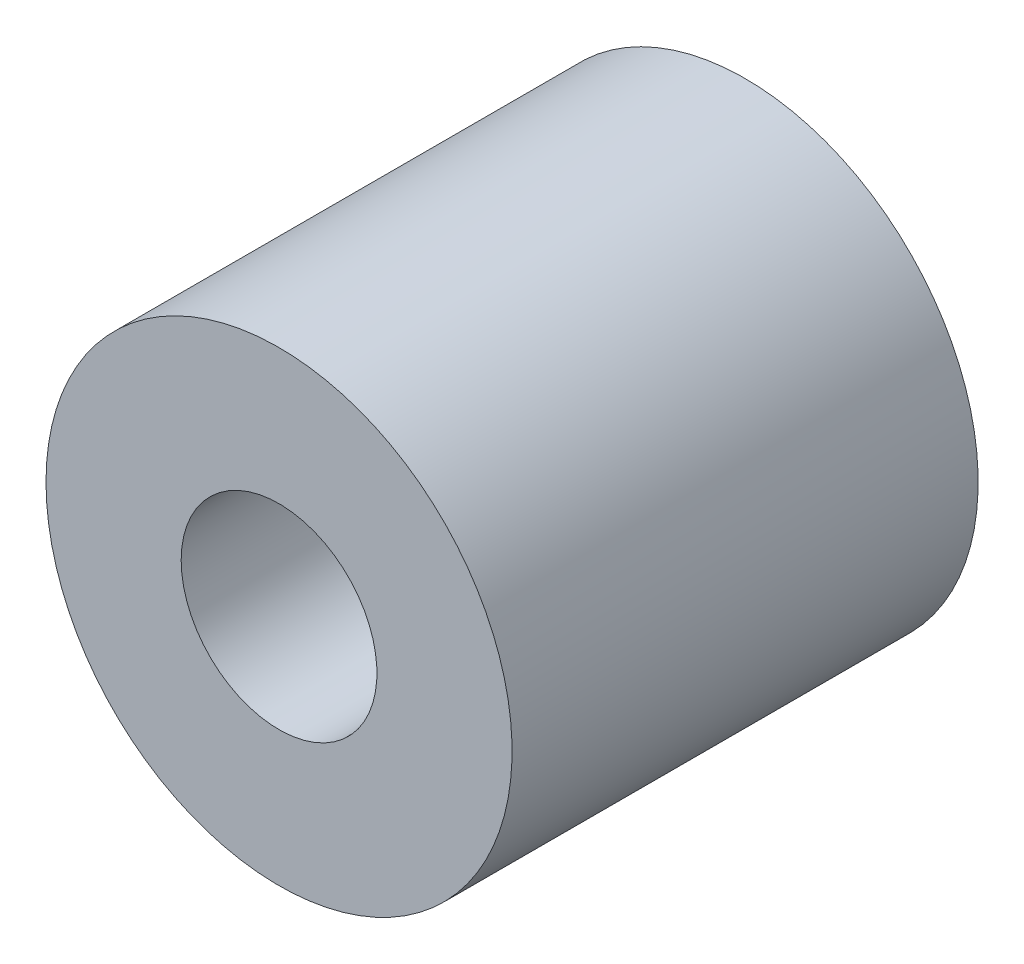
from build123d import *

# Parameters (mm, degrees)
SKETCH1_R           = 9.525
SKETCH1_R_2         = 4.0005
BOSS_EXTRUDE1_DEPTH = 19.05


with BuildPart() as part:
    # Sketch1 → Boss-Extrude1 (new body)
    with BuildSketch(Plane.XY):
        with Locations(Location((0, 0, 0), (0, 0, 180))):
            Circle(SKETCH1_R)
        with Locations(Location((0, 0, 0), (0, 0, 180))):
            Circle(SKETCH1_R_2, mode=Mode.SUBTRACT)
    extrude(amount=BOSS_EXTRUDE1_DEPTH)


solid = part.part
